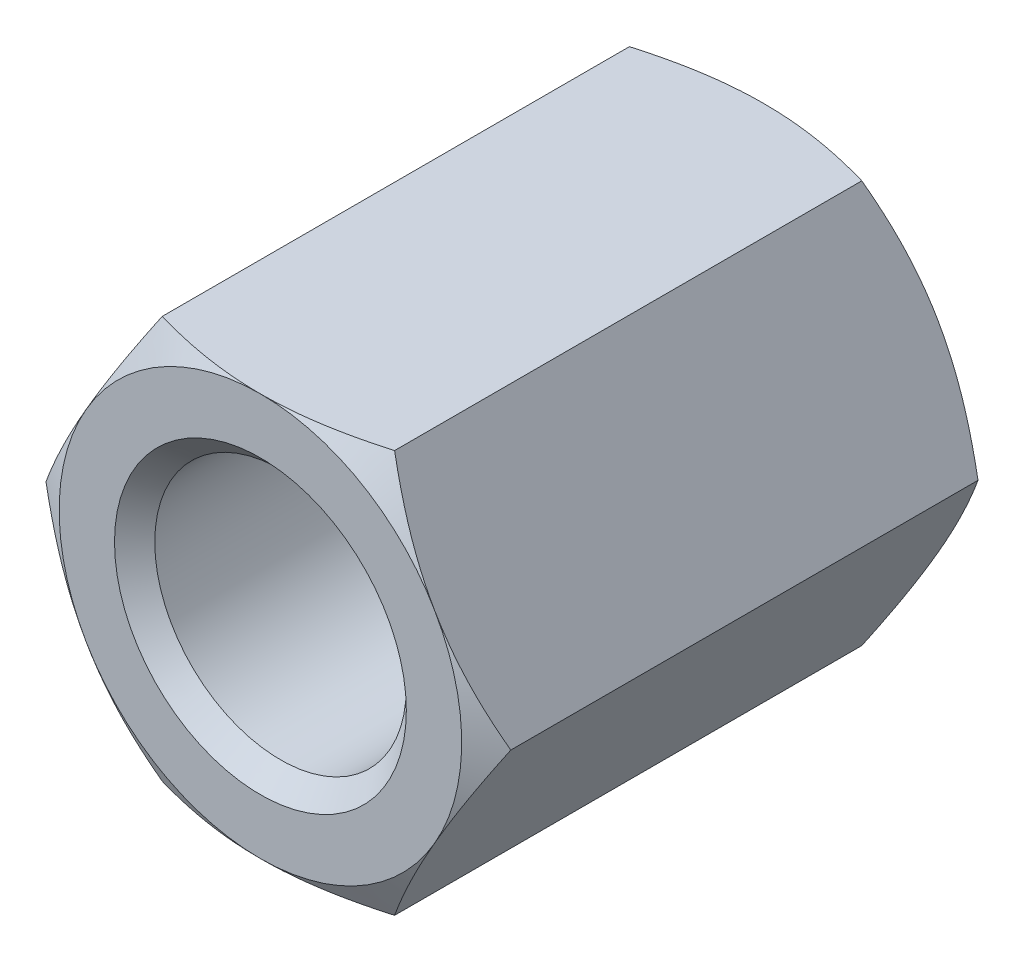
ISO-10303-21;
HEADER;
FILE_DESCRIPTION(('STEP AP214'),'2;1');
FILE_NAME('part.step','',(''),(''),'','','');
FILE_SCHEMA(('AUTOMOTIVE_DESIGN { 1 0 10303 214 1 1 1 1 }'));
ENDSEC;
DATA;
#1=APPLICATION_CONTEXT('core data for automotive mechanical design processes');
#2=APPLICATION_PROTOCOL_DEFINITION('international standard','automotive_design',2000,#1);
#3=PRODUCT_CONTEXT('',#1,'mechanical');
#4=PRODUCT('Part','Part','',(#3));
#5=PRODUCT_RELATED_PRODUCT_CATEGORY('part','',(#4));
#6=PRODUCT_DEFINITION_FORMATION('','',#4);
#7=PRODUCT_DEFINITION_CONTEXT('part definition',#1,'design');
#8=PRODUCT_DEFINITION('design','',#6,#7);
#9=PRODUCT_DEFINITION_SHAPE('','',#8);
#10=(LENGTH_UNIT() NAMED_UNIT(*) SI_UNIT(.MILLI.,.METRE.));
#11=(NAMED_UNIT(*) PLANE_ANGLE_UNIT() SI_UNIT($,.RADIAN.));
#12=(NAMED_UNIT(*) SI_UNIT($,.STERADIAN.) SOLID_ANGLE_UNIT());
#13=UNCERTAINTY_MEASURE_WITH_UNIT(LENGTH_MEASURE(1.E-05),#10,'distance_accuracy_value','');
#14=(GEOMETRIC_REPRESENTATION_CONTEXT(3) GLOBAL_UNCERTAINTY_ASSIGNED_CONTEXT((#13)) GLOBAL_UNIT_ASSIGNED_CONTEXT((#10,
#11,#12)) REPRESENTATION_CONTEXT('',''));
#15=CARTESIAN_POINT('',(0.,0.,0.));
#16=DIRECTION('',(0.,0.,1.));
#17=DIRECTION('',(1.,0.,0.));
#18=AXIS2_PLACEMENT_3D('',#15,#16,#17);
#19=CARTESIAN_POINT('',(4.61880215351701,0.,-5.));
#20=DIRECTION('',(0.866025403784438,0.5,0.));
#21=DIRECTION('',(-0.5,0.866025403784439,0.));
#22=AXIS2_PLACEMENT_3D('',#19,#20,#21);
#23=PLANE('',#22);
#24=CARTESIAN_POINT('',(4.61891762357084,-0.000199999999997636,4.64266774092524));
#25=CARTESIAN_POINT('',(4.5174314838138,0.17557915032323,4.70128212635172));
#26=CARTESIAN_POINT('',(4.41506932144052,0.352875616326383,4.75458967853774));
#27=CARTESIAN_POINT('',(4.20857250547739,0.710538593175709,4.8476383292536));
#28=CARTESIAN_POINT('',(4.10443418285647,0.890911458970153,4.8873465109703));
#29=CARTESIAN_POINT('',(3.89744813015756,1.24942181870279,4.94915778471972));
#30=CARTESIAN_POINT('',(3.79463224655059,1.42750415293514,4.97167226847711));
#31=CARTESIAN_POINT('',(3.58851671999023,1.78450671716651,4.99854937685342));
#32=CARTESIAN_POINT('',(3.48521782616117,1.9634256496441,5.00293425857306));
#33=CARTESIAN_POINT('',(3.29219970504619,2.29774284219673,4.99380992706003));
#34=CARTESIAN_POINT('',(3.20245157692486,2.45319115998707,4.98254104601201));
#35=CARTESIAN_POINT('',(3.02354002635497,2.76307505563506,4.94682600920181));
#36=CARTESIAN_POINT('',(2.93437722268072,2.91750956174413,4.92236765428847));
#37=CARTESIAN_POINT('',(2.75509682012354,3.22803232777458,4.86122393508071));
#38=CARTESIAN_POINT('',(2.6650019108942,3.3840812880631,4.82427939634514));
#39=CARTESIAN_POINT('',(2.48615580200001,3.69385183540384,4.74042992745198));
#40=CARTESIAN_POINT('',(2.39740231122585,3.84757739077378,4.69354469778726));
#41=CARTESIAN_POINT('',(2.30928560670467,4.0002,4.64266774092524));
#42=B_SPLINE_CURVE_WITH_KNOTS('',3,(#24,#25,#26,#27,#28,#29,#30,#31,#32,#33,#34,#35,#36,#37,#38,
#39,#40,#41),.UNSPECIFIED.,.F.,.F.,(4,2,2,2,2,2,2,2,4),(0.,0.634047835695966,1.26961969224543,
1.88946157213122,2.50854226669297,3.04757825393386,3.58711366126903,4.13861653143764,
4.68903648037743),.UNSPECIFIED.);
#43=CARTESIAN_POINT('',(4.61880215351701,0.,4.64273441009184));
#44=VERTEX_POINT('',#43);
#45=CARTESIAN_POINT('',(3.46410161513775,2.,5.));
#46=VERTEX_POINT('',#45);
#47=EDGE_CURVE('E127',#44,#46,#42,.T.);
#48=ORIENTED_EDGE('',*,*,#47,.F.);
#49=DIRECTION('',(0.,0.,1.));
#50=VECTOR('',#49,1.);
#51=CARTESIAN_POINT('',(4.61880215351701,0.,-5.));
#52=LINE('',#51,#50);
#53=CARTESIAN_POINT('',(4.61880215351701,0.,-4.64273441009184));
#54=VERTEX_POINT('',#53);
#55=EDGE_CURVE('E550',#54,#44,#52,.T.);
#56=ORIENTED_EDGE('',*,*,#55,.F.);
#57=CARTESIAN_POINT('',(4.61891762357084,-0.000199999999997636,-4.64266774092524));
#58=CARTESIAN_POINT('',(4.5174314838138,0.17557915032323,-4.70128212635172));
#59=CARTESIAN_POINT('',(4.41506932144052,0.352875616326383,-4.75458967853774));
#60=CARTESIAN_POINT('',(4.20857250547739,0.710538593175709,-4.8476383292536));
#61=CARTESIAN_POINT('',(4.10443418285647,0.890911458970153,-4.8873465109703));
#62=CARTESIAN_POINT('',(3.89744813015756,1.24942181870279,-4.94915778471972));
#63=CARTESIAN_POINT('',(3.79463224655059,1.42750415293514,-4.97167226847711));
#64=CARTESIAN_POINT('',(3.58851671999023,1.78450671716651,-4.99854937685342));
#65=CARTESIAN_POINT('',(3.48521782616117,1.9634256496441,-5.00293425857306));
#66=CARTESIAN_POINT('',(3.29219970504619,2.29774284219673,-4.99380992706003));
#67=CARTESIAN_POINT('',(3.20245157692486,2.45319115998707,-4.98254104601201));
#68=CARTESIAN_POINT('',(3.02354002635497,2.76307505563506,-4.94682600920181));
#69=CARTESIAN_POINT('',(2.93437722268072,2.91750956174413,-4.92236765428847));
#70=CARTESIAN_POINT('',(2.75509682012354,3.22803232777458,-4.86122393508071));
#71=CARTESIAN_POINT('',(2.6650019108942,3.3840812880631,-4.82427939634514));
#72=CARTESIAN_POINT('',(2.48615580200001,3.69385183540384,-4.74042992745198));
#73=CARTESIAN_POINT('',(2.39740231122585,3.84757739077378,-4.69354469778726));
#74=CARTESIAN_POINT('',(2.30928560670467,4.0002,-4.64266774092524));
#75=B_SPLINE_CURVE_WITH_KNOTS('',3,(#57,#58,#59,#60,#61,#62,#63,#64,#65,#66,#67,#68,#69,#70,#71,
#72,#73,#74),.UNSPECIFIED.,.F.,.F.,(4,2,2,2,2,2,2,2,4),(0.,0.634047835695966,1.26961969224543,
1.88946157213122,2.50854226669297,3.04757825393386,3.58711366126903,4.13861653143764,
4.68903648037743),.UNSPECIFIED.);
#76=CARTESIAN_POINT('',(3.46410161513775,2.,-5.));
#77=VERTEX_POINT('',#76);
#78=EDGE_CURVE('E568',#54,#77,#75,.T.);
#79=ORIENTED_EDGE('',*,*,#78,.T.);
#80=CARTESIAN_POINT('',(2.3094010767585,4.,-4.64273441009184));
#81=VERTEX_POINT('',#80);
#82=EDGE_CURVE('E268',#77,#81,#75,.T.);
#83=ORIENTED_EDGE('',*,*,#82,.T.);
#84=DIRECTION('',(0.,0.,1.));
#85=VECTOR('',#84,1.);
#86=CARTESIAN_POINT('',(2.3094010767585,4.,-5.));
#87=LINE('',#86,#85);
#88=CARTESIAN_POINT('',(2.3094010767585,4.,4.64273441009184));
#89=VERTEX_POINT('',#88);
#90=EDGE_CURVE('E159',#81,#89,#87,.T.);
#91=ORIENTED_EDGE('',*,*,#90,.T.);
#92=EDGE_CURVE('E140',#46,#89,#42,.T.);
#93=ORIENTED_EDGE('',*,*,#92,.F.);
#94=EDGE_LOOP('',(#48,#56,#79,#83,#91,#93));
#95=FACE_BOUND('',#94,.T.);
#96=ADVANCED_FACE('F41',(#95),#23,.T.);
#97=CARTESIAN_POINT('',(2.3094010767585,-4.,-5.));
#98=DIRECTION('',(0.866025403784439,-0.5,0.));
#99=DIRECTION('',(0.5,0.866025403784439,0.));
#100=AXIS2_PLACEMENT_3D('',#97,#98,#99);
#101=PLANE('',#100);
#102=CARTESIAN_POINT('',(2.30928560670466,-4.0002,4.64266774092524));
#103=CARTESIAN_POINT('',(2.4107717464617,-3.82442084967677,4.70128212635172));
#104=CARTESIAN_POINT('',(2.51313390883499,-3.64712438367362,4.75458967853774));
#105=CARTESIAN_POINT('',(2.71963072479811,-3.28946140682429,4.8476383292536));
#106=CARTESIAN_POINT('',(2.82376904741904,-3.10908854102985,4.8873465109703));
#107=CARTESIAN_POINT('',(3.03075510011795,-2.75057818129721,4.94915778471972));
#108=CARTESIAN_POINT('',(3.13357098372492,-2.57249584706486,4.97167226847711));
#109=CARTESIAN_POINT('',(3.33968651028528,-2.21549328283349,4.99854937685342));
#110=CARTESIAN_POINT('',(3.44298540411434,-2.0365743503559,5.00293425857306));
#111=CARTESIAN_POINT('',(3.63600352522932,-1.70225715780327,4.99380992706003));
#112=CARTESIAN_POINT('',(3.72575165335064,-1.54680884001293,4.98254104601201));
#113=CARTESIAN_POINT('',(3.90466320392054,-1.23692494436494,4.94682600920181));
#114=CARTESIAN_POINT('',(3.99382600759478,-1.08249043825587,4.92236765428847));
#115=CARTESIAN_POINT('',(4.17310641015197,-0.771967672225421,4.86122393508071));
#116=CARTESIAN_POINT('',(4.26320131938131,-0.615918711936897,4.82427939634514));
#117=CARTESIAN_POINT('',(4.4420474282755,-0.306148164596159,4.74042992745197));
#118=CARTESIAN_POINT('',(4.53080091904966,-0.152422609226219,4.69354469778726));
#119=CARTESIAN_POINT('',(4.61891762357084,0.000200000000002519,4.64266774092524));
#120=B_SPLINE_CURVE_WITH_KNOTS('',3,(#102,#103,#104,#105,#106,#107,#108,#109,#110,#111,#112,
#113,#114,#115,#116,#117,#118,#119),.UNSPECIFIED.,.F.,.F.,(4,2,2,2,2,2,2,2,4),(0.,
0.634047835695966,1.26961969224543,1.88946157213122,2.50854226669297,3.04757825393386,
3.58711366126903,4.13861653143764,4.68903648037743),.UNSPECIFIED.);
#121=CARTESIAN_POINT('',(2.3094010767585,-4.,4.64273441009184));
#122=VERTEX_POINT('',#121);
#123=CARTESIAN_POINT('',(3.46410161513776,-2.,5.));
#124=VERTEX_POINT('',#123);
#125=EDGE_CURVE('E534',#122,#124,#120,.T.);
#126=ORIENTED_EDGE('',*,*,#125,.F.);
#127=DIRECTION('',(0.,0.,1.));
#128=VECTOR('',#127,1.);
#129=CARTESIAN_POINT('',(2.3094010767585,-4.,-5.));
#130=LINE('',#129,#128);
#131=CARTESIAN_POINT('',(2.3094010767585,-4.,-4.64273441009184));
#132=VERTEX_POINT('',#131);
#133=EDGE_CURVE('E282',#132,#122,#130,.T.);
#134=ORIENTED_EDGE('',*,*,#133,.F.);
#135=CARTESIAN_POINT('',(2.30928560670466,-4.0002,-4.64266774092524));
#136=CARTESIAN_POINT('',(2.4107717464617,-3.82442084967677,-4.70128212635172));
#137=CARTESIAN_POINT('',(2.51313390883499,-3.64712438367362,-4.75458967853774));
#138=CARTESIAN_POINT('',(2.71963072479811,-3.28946140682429,-4.8476383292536));
#139=CARTESIAN_POINT('',(2.82376904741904,-3.10908854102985,-4.8873465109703));
#140=CARTESIAN_POINT('',(3.03075510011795,-2.75057818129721,-4.94915778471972));
#141=CARTESIAN_POINT('',(3.13357098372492,-2.57249584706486,-4.97167226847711));
#142=CARTESIAN_POINT('',(3.33968651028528,-2.21549328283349,-4.99854937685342));
#143=CARTESIAN_POINT('',(3.44298540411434,-2.0365743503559,-5.00293425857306));
#144=CARTESIAN_POINT('',(3.63600352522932,-1.70225715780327,-4.99380992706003));
#145=CARTESIAN_POINT('',(3.72575165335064,-1.54680884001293,-4.98254104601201));
#146=CARTESIAN_POINT('',(3.90466320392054,-1.23692494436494,-4.94682600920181));
#147=CARTESIAN_POINT('',(3.99382600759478,-1.08249043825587,-4.92236765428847));
#148=CARTESIAN_POINT('',(4.17310641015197,-0.771967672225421,-4.86122393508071));
#149=CARTESIAN_POINT('',(4.26320131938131,-0.615918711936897,-4.82427939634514));
#150=CARTESIAN_POINT('',(4.4420474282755,-0.306148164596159,-4.74042992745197));
#151=CARTESIAN_POINT('',(4.53080091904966,-0.152422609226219,-4.69354469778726));
#152=CARTESIAN_POINT('',(4.61891762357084,0.000200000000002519,-4.64266774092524));
#153=B_SPLINE_CURVE_WITH_KNOTS('',3,(#135,#136,#137,#138,#139,#140,#141,#142,#143,#144,#145,
#146,#147,#148,#149,#150,#151,#152),.UNSPECIFIED.,.F.,.F.,(4,2,2,2,2,2,2,2,4),(0.,
0.634047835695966,1.26961969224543,1.88946157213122,2.50854226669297,3.04757825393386,
3.58711366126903,4.13861653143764,4.68903648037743),.UNSPECIFIED.);
#154=CARTESIAN_POINT('',(3.46410161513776,-2.,-5.));
#155=VERTEX_POINT('',#154);
#156=EDGE_CURVE('E525',#132,#155,#153,.T.);
#157=ORIENTED_EDGE('',*,*,#156,.T.);
#158=EDGE_CURVE('E283',#155,#54,#153,.T.);
#159=ORIENTED_EDGE('',*,*,#158,.T.);
#160=ORIENTED_EDGE('',*,*,#55,.T.);
#161=EDGE_CURVE('E132',#124,#44,#120,.T.);
#162=ORIENTED_EDGE('',*,*,#161,.F.);
#163=EDGE_LOOP('',(#126,#134,#157,#159,#160,#162));
#164=FACE_BOUND('',#163,.T.);
#165=ADVANCED_FACE('F253',(#164),#101,.T.);
#166=CARTESIAN_POINT('',(-2.3094010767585,-4.,-5.));
#167=DIRECTION('',(0.,-1.,0.));
#168=DIRECTION('',(0.,0.,-1.));
#169=AXIS2_PLACEMENT_3D('',#166,#167,#168);
#170=PLANE('',#169);
#171=CARTESIAN_POINT('',(-11.5279836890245,-4.,0.264440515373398));
#172=CARTESIAN_POINT('',(-11.2715120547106,-4.,0.404321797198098));
#173=CARTESIAN_POINT('',(-11.014837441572,-4.,0.543832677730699));
#174=CARTESIAN_POINT('',(-10.5009754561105,-4.,0.821916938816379));
#175=CARTESIAN_POINT('',(-10.2437880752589,-4.,0.960490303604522));
#176=CARTESIAN_POINT('',(-9.72862819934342,-4.,1.2365914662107));
#177=CARTESIAN_POINT('',(-9.47065529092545,-4.,1.37411849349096));
#178=CARTESIAN_POINT('',(-8.95395916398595,-4.,1.64775277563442));
#179=CARTESIAN_POINT('',(-8.69523595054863,-4.,1.78386004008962));
#180=CARTESIAN_POINT('',(-8.16951167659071,-4.,2.05811973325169));
#181=CARTESIAN_POINT('',(-7.90248379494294,-4.,2.19622082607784));
#182=CARTESIAN_POINT('',(-7.36718088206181,-4.,2.46998268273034));
#183=CARTESIAN_POINT('',(-7.09890586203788,-4.,2.60564346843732));
#184=CARTESIAN_POINT('',(-6.5608262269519,-4.,2.87371521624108));
#185=CARTESIAN_POINT('',(-6.29102206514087,-4.,3.00612708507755));
#186=CARTESIAN_POINT('',(-5.74933668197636,-4.,3.26661334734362));
#187=CARTESIAN_POINT('',(-5.47745554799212,-4.,3.39468792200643));
#188=CARTESIAN_POINT('',(-4.92135065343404,-4.,3.64926272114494));
#189=CARTESIAN_POINT('',(-4.6370284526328,-4.,3.77555017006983));
#190=CARTESIAN_POINT('',(-4.20754891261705,-4.,3.95807487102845));
#191=CARTESIAN_POINT('',(-4.06386416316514,-4.,4.01777524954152));
#192=CARTESIAN_POINT('',(-3.77535865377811,-4.,4.13435814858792));
#193=CARTESIAN_POINT('',(-3.63053794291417,-4.,4.19124079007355));
#194=CARTESIAN_POINT('',(-3.34059820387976,-4.,4.30120468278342));
#195=CARTESIAN_POINT('',(-3.19548814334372,-4.,4.35430947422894));
#196=CARTESIAN_POINT('',(-2.90381608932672,-4.,4.45640888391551));
#197=CARTESIAN_POINT('',(-2.75725404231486,-4.,4.50540334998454));
#198=CARTESIAN_POINT('',(-2.46259054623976,-4.,4.59836548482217));
#199=CARTESIAN_POINT('',(-2.31448970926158,-4.,4.64233507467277));
#200=CARTESIAN_POINT('',(-2.01662643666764,-4.,4.72421146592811));
#201=CARTESIAN_POINT('',(-1.86686405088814,-4.,4.76211844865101));
#202=CARTESIAN_POINT('',(-1.49841751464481,-4.,4.84598275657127));
#203=CARTESIAN_POINT('',(-1.2787913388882,-4.,4.88798746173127));
#204=CARTESIAN_POINT('',(-0.947334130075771,-4.,4.93691975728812));
#205=CARTESIAN_POINT('',(-0.836518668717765,-4.,4.95088431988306));
#206=CARTESIAN_POINT('',(-0.61437144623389,-4.,4.97376962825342));
#207=CARTESIAN_POINT('',(-0.503039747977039,-4.,4.98269097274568));
#208=CARTESIAN_POINT('',(-0.280424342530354,-4.,4.99521270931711));
#209=CARTESIAN_POINT('',(-0.169141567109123,-4.,4.99882959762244));
#210=CARTESIAN_POINT('',(0.0534682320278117,-4.,5.00068760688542));
#211=CARTESIAN_POINT('',(0.164795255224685,-4.,4.99892878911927));
#212=CARTESIAN_POINT('',(0.387249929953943,-4.,4.99008741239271));
#213=CARTESIAN_POINT('',(0.498377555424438,-4.,4.98300420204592));
#214=CARTESIAN_POINT('',(0.72019050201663,-4.,4.96372103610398));
#215=CARTESIAN_POINT('',(0.830875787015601,-4.,4.95152067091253));
#216=CARTESIAN_POINT('',(1.09884160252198,-4.,4.91608140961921));
#217=CARTESIAN_POINT('',(1.25579519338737,-4.,4.89035300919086));
#218=CARTESIAN_POINT('',(1.56805927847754,-4.,4.83034903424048));
#219=CARTESIAN_POINT('',(1.72336945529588,-4.,4.79607183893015));
#220=CARTESIAN_POINT('',(2.03236005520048,-4.,4.72026345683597));
#221=CARTESIAN_POINT('',(2.186038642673,-4.,4.67872486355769));
#222=CARTESIAN_POINT('',(2.49163073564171,-4.,4.58966949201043));
#223=CARTESIAN_POINT('',(2.64354431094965,-4.,4.54215295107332));
#224=CARTESIAN_POINT('',(2.9484257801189,-4.,4.44134014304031));
#225=CARTESIAN_POINT('',(3.10136449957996,-4.,4.38795623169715));
#226=CARTESIAN_POINT('',(3.40573396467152,-4.,4.27707035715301));
#227=CARTESIAN_POINT('',(3.55716470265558,-4.,4.21956837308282));
#228=CARTESIAN_POINT('',(3.85861478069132,-4.,4.10125036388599));
#229=CARTESIAN_POINT('',(4.00863491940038,-4.,4.04043636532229));
#230=CARTESIAN_POINT('',(4.30753677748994,-4.,3.91606609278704));
#231=CARTESIAN_POINT('',(4.45641845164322,-4.,3.85250971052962));
#232=CARTESIAN_POINT('',(4.91043290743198,-4.,3.65463397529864));
#233=CARTESIAN_POINT('',(5.21398386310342,-4.,3.51668753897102));
#234=CARTESIAN_POINT('',(5.81806588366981,-4.,3.23432963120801));
#235=CARTESIAN_POINT('',(6.11859667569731,-4.,3.08991758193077));
#236=CARTESIAN_POINT('',(6.71756026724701,-4.,2.79643693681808));
#237=CARTESIAN_POINT('',(7.01599191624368,-4.,2.64736599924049));
#238=CARTESIAN_POINT('',(7.61116391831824,-4.,2.34588529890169));
#239=CARTESIAN_POINT('',(7.90790424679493,-4.,2.19347548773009));
#240=CARTESIAN_POINT('',(8.48290085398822,-4.,1.89507766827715));
#241=CARTESIAN_POINT('',(8.76123029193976,-4.,1.74923038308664));
#242=CARTESIAN_POINT('',(9.3169822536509,-4.,1.45581152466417));
#243=CARTESIAN_POINT('',(9.59440476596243,-4.,1.3082399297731));
#244=CARTESIAN_POINT('',(10.1481927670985,-4.,1.01191517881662));
#245=CARTESIAN_POINT('',(10.4245591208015,-4.,0.863163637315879));
#246=CARTESIAN_POINT('',(10.9766890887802,-4.,0.564562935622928));
#247=CARTESIAN_POINT('',(11.2524527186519,-4.,0.414713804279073));
#248=CARTESIAN_POINT('',(11.5279836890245,-4.,0.264440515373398));
#249=B_SPLINE_CURVE_WITH_KNOTS('',3,(#171,#172,#173,#174,#175,#176,#177,#178,#179,#180,#181,
#182,#183,#184,#185,#186,#187,#188,#189,#190,#191,#192,#193,#194,#195,#196,#197,#198,#199,#200,
#201,#202,#203,#204,#205,#206,#207,#208,#209,#210,#211,#212,#213,#214,#215,#216,#217,#218,#219,
#220,#221,#222,#223,#224,#225,#226,#227,#228,#229,#230,#231,#232,#233,#234,#235,#236,#237,#238,
#239,#240,#241,#242,#243,#244,#245,#246,#247,#248),.UNSPECIFIED.,.F.,.F.,(4,2,2,2,2,2,2,2,2,2,2,
2,2,2,2,2,2,2,2,2,2,2,2,2,2,2,2,2,2,2,2,2,2,2,2,2,2,2,4),(0.,0.876414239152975,1.75284317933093,
2.62986487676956,3.50688064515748,4.40874802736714,5.31060731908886,6.21221198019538,
7.11377892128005,8.04696753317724,8.51372602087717,8.98046445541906,9.44397948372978,
9.90751166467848,10.3708660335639,10.8342065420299,11.5042466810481,11.8392272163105,
12.1741679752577,12.5080648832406,12.8419579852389,13.17589194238,13.5098526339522,
13.986706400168,14.4636506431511,14.9410842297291,15.4184988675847,15.904390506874,
16.3902846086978,16.8758846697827,17.361503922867,18.3616495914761,19.3618848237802,
20.3626311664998,21.3633920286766,22.3060660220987,23.2487518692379,24.1903162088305,
25.1318558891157),.UNSPECIFIED.);
#250=CARTESIAN_POINT('',(-2.3094010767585,-4.,4.64273441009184));
#251=VERTEX_POINT('',#250);
#252=CARTESIAN_POINT('',(0.,-4.,5.));
#253=VERTEX_POINT('',#252);
#254=EDGE_CURVE('E535',#251,#253,#249,.T.);
#255=ORIENTED_EDGE('',*,*,#254,.F.);
#256=DIRECTION('',(0.,0.,1.));
#257=VECTOR('',#256,1.);
#258=CARTESIAN_POINT('',(-2.3094010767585,-4.,-5.));
#259=LINE('',#258,#257);
#260=CARTESIAN_POINT('',(-2.3094010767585,-4.,-4.64273441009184));
#261=VERTEX_POINT('',#260);
#262=EDGE_CURVE('E543',#261,#251,#259,.T.);
#263=ORIENTED_EDGE('',*,*,#262,.F.);
#264=CARTESIAN_POINT('',(-8.69602503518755,-4.,-1.78307464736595));
#265=CARTESIAN_POINT('',(-8.49611251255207,-4.,-1.88792065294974));
#266=CARTESIAN_POINT('',(-8.29594853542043,-4.,-1.99229080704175));
#267=CARTESIAN_POINT('',(-7.89499317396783,-4.,-2.19983732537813));
#268=CARTESIAN_POINT('',(-7.6942017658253,-4.,-2.30301364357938));
#269=CARTESIAN_POINT('',(-7.29160376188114,-4.,-2.50806421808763));
#270=CARTESIAN_POINT('',(-7.08979614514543,-4.,-2.60993647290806));
#271=CARTESIAN_POINT('',(-6.68528979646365,-4.,-2.81189167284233));
#272=CARTESIAN_POINT('',(-6.4825910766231,-4.,-2.91197464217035));
#273=CARTESIAN_POINT('',(-6.06448557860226,-4.,-3.11557048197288));
#274=CARTESIAN_POINT('',(-5.84901482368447,-4.,-3.21895229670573));
#275=CARTESIAN_POINT('',(-5.41656991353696,-4.,-3.42251948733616));
#276=CARTESIAN_POINT('',(-5.19959579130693,-4.,-3.52270493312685));
#277=CARTESIAN_POINT('',(-4.76386694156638,-4.,-3.71886671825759));
#278=CARTESIAN_POINT('',(-4.54511310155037,-4.,-3.81484501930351));
#279=CARTESIAN_POINT('',(-4.10527612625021,-4.,-4.0012803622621));
#280=CARTESIAN_POINT('',(-3.88419319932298,-4.,-4.09173789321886));
#281=CARTESIAN_POINT('',(-3.4154259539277,-4.,-4.27448818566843));
#282=CARTESIAN_POINT('',(-3.16741421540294,-4.,-4.36595206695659));
#283=CARTESIAN_POINT('',(-2.66696594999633,-4.,-4.53620795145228));
#284=CARTESIAN_POINT('',(-2.414528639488,-4.,-4.61499768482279));
#285=CARTESIAN_POINT('',(-1.90996213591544,-4.,-4.7533698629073));
#286=CARTESIAN_POINT('',(-1.6579378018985,-4.,-4.81332092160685));
#287=CARTESIAN_POINT('',(-1.27669072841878,-4.,-4.88621054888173));
#288=CARTESIAN_POINT('',(-1.14908560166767,-4.,-4.90766636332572));
#289=CARTESIAN_POINT('',(-0.892978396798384,-4.,-4.94423514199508));
#290=CARTESIAN_POINT('',(-0.764476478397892,-4.,-4.95934920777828));
#291=CARTESIAN_POINT('',(-0.504299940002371,-4.,-4.98292333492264));
#292=CARTESIAN_POINT('',(-0.372612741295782,-4.,-4.99124624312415));
#293=CARTESIAN_POINT('',(-0.108976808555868,-4.,-5.0003923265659));
#294=CARTESIAN_POINT('',(0.0229719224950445,-4.,-5.00121558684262));
#295=CARTESIAN_POINT('',(0.286704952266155,-4.,-4.99532522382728));
#296=CARTESIAN_POINT('',(0.418489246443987,-4.,-4.98861139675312));
#297=CARTESIAN_POINT('',(0.68147434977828,-4.,-4.96793379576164));
#298=CARTESIAN_POINT('',(0.81267514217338,-4.,-4.95396981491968));
#299=CARTESIAN_POINT('',(1.21065133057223,-4.,-4.90120738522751));
#300=CARTESIAN_POINT('',(1.47605192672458,-4.,-4.85169892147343));
#301=CARTESIAN_POINT('',(1.87020328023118,-4.,-4.76100184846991));
#302=CARTESIAN_POINT('',(2.00098109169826,-4.,-4.72801369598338));
#303=CARTESIAN_POINT('',(2.2612728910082,-4.,-4.65734443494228));
#304=CARTESIAN_POINT('',(2.3907868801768,-4.,-4.61966333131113));
#305=CARTESIAN_POINT('',(2.79931594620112,-4.,-4.49396970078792));
#306=CARTESIAN_POINT('',(3.07606767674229,-4.,-4.39862345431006));
#307=CARTESIAN_POINT('',(3.62485463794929,-4.,-4.19516528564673));
#308=CARTESIAN_POINT('',(3.89688778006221,-4.,-4.0870478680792));
#309=CARTESIAN_POINT('',(4.4377025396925,-4.,-3.86178687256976));
#310=CARTESIAN_POINT('',(4.70647788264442,-4.,-3.74462834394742));
#311=CARTESIAN_POINT('',(5.24114190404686,-4.,-3.50407341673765));
#312=CARTESIAN_POINT('',(5.50703109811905,-4.,-3.38067815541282));
#313=CARTESIAN_POINT('',(6.01890761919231,-4.,-3.13777103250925));
#314=CARTESIAN_POINT('',(6.26503489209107,-4.,-3.01855282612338));
#315=CARTESIAN_POINT('',(6.75582775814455,-4.,-2.77711941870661));
#316=CARTESIAN_POINT('',(7.00049327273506,-4.,-2.65490405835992));
#317=CARTESIAN_POINT('',(7.48750627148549,-4.,-2.40875757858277));
#318=CARTESIAN_POINT('',(7.729859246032,-4.,-2.28483729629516));
#319=CARTESIAN_POINT('',(8.21360283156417,-4.,-2.03519497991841));
#320=CARTESIAN_POINT('',(8.45499354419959,-4.,-1.90947314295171));
#321=CARTESIAN_POINT('',(8.69602503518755,-4.,-1.78307464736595));
#322=B_SPLINE_CURVE_WITH_KNOTS('',3,(#264,#265,#266,#267,#268,#269,#270,#271,#272,#273,#274,
#275,#276,#277,#278,#279,#280,#281,#282,#283,#284,#285,#286,#287,#288,#289,#290,#291,#292,#293,
#294,#295,#296,#297,#298,#299,#300,#301,#302,#303,#304,#305,#306,#307,#308,#309,#310,#311,#312,
#313,#314,#315,#316,#317,#318,#319,#320,#321),.UNSPECIFIED.,.F.,.F.,(4,2,2,2,2,2,2,2,2,2,2,2,2,
2,2,2,2,2,2,2,2,2,2,2,2,2,2,2,4),(0.,0.677216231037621,1.35445849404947,2.03263882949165,
2.71080998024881,3.42775480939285,4.1446839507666,4.86127516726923,5.57780281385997,
6.37057240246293,7.1634838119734,7.93974372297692,8.3277996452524,8.71578813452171,
9.11143089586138,9.50706917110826,9.90271814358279,10.2983784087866,11.1068625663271,
11.5114332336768,11.9160034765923,12.7936254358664,13.6716264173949,14.5511117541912,
15.4304372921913,16.2508534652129,17.0713133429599,17.8878960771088,18.7043901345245),.UNSPECIFIED.);
#323=CARTESIAN_POINT('',(0.,-4.,-5.));
#324=VERTEX_POINT('',#323);
#325=EDGE_CURVE('E552',#261,#324,#322,.T.);
#326=ORIENTED_EDGE('',*,*,#325,.T.);
#327=EDGE_CURVE('E258',#324,#132,#322,.T.);
#328=ORIENTED_EDGE('',*,*,#327,.T.);
#329=ORIENTED_EDGE('',*,*,#133,.T.);
#330=EDGE_CURVE('E138',#253,#122,#249,.T.);
#331=ORIENTED_EDGE('',*,*,#330,.F.);
#332=EDGE_LOOP('',(#255,#263,#326,#328,#329,#331));
#333=FACE_BOUND('',#332,.T.);
#334=ADVANCED_FACE('F291',(#333),#170,.T.);
#335=CARTESIAN_POINT('',(-4.61880215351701,0.,-5.));
#336=DIRECTION('',(-0.866025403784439,-0.5,0.));
#337=DIRECTION('',(0.5,-0.866025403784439,0.));
#338=AXIS2_PLACEMENT_3D('',#335,#336,#337);
#339=PLANE('',#338);
#340=CARTESIAN_POINT('',(-4.61891762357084,0.00020000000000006,4.64266774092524));
#341=CARTESIAN_POINT('',(-4.5174314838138,-0.175579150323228,4.70128212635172));
#342=CARTESIAN_POINT('',(-4.41506932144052,-0.352875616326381,4.75458967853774));
#343=CARTESIAN_POINT('',(-4.20857250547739,-0.710538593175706,4.8476383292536));
#344=CARTESIAN_POINT('',(-4.10443418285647,-0.890911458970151,4.8873465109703));
#345=CARTESIAN_POINT('',(-3.89744813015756,-1.24942181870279,4.94915778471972));
#346=CARTESIAN_POINT('',(-3.79463224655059,-1.42750415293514,4.97167226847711));
#347=CARTESIAN_POINT('',(-3.58851671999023,-1.78450671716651,4.99854937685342));
#348=CARTESIAN_POINT('',(-3.48521782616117,-1.9634256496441,5.00293425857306));
#349=CARTESIAN_POINT('',(-3.29219970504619,-2.29774284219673,4.99380992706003));
#350=CARTESIAN_POINT('',(-3.20245157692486,-2.45319115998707,4.98254104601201));
#351=CARTESIAN_POINT('',(-3.02354002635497,-2.76307505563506,4.94682600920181));
#352=CARTESIAN_POINT('',(-2.93437722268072,-2.91750956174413,4.92236765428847));
#353=CARTESIAN_POINT('',(-2.75509682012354,-3.22803232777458,4.86122393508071));
#354=CARTESIAN_POINT('',(-2.6650019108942,-3.3840812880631,4.82427939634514));
#355=CARTESIAN_POINT('',(-2.48615580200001,-3.69385183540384,4.74042992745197));
#356=CARTESIAN_POINT('',(-2.39740231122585,-3.84757739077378,4.69354469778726));
#357=CARTESIAN_POINT('',(-2.30928560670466,-4.0002,4.64266774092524));
#358=B_SPLINE_CURVE_WITH_KNOTS('',3,(#340,#341,#342,#343,#344,#345,#346,#347,#348,#349,#350,
#351,#352,#353,#354,#355,#356,#357),.UNSPECIFIED.,.F.,.F.,(4,2,2,2,2,2,2,2,4),(0.,
0.634047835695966,1.26961969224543,1.88946157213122,2.50854226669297,3.04757825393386,
3.58711366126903,4.13861653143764,4.68903648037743),.UNSPECIFIED.);
#359=CARTESIAN_POINT('',(-4.61880215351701,0.,4.64273441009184));
#360=VERTEX_POINT('',#359);
#361=CARTESIAN_POINT('',(-3.46410161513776,-2.,5.));
#362=VERTEX_POINT('',#361);
#363=EDGE_CURVE('E175',#360,#362,#358,.T.);
#364=ORIENTED_EDGE('',*,*,#363,.F.);
#365=DIRECTION('',(0.,0.,1.));
#366=VECTOR('',#365,1.);
#367=CARTESIAN_POINT('',(-4.61880215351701,0.,-5.));
#368=LINE('',#367,#366);
#369=CARTESIAN_POINT('',(-4.61880215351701,0.,-4.64273441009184));
#370=VERTEX_POINT('',#369);
#371=EDGE_CURVE('E539',#370,#360,#368,.T.);
#372=ORIENTED_EDGE('',*,*,#371,.F.);
#373=CARTESIAN_POINT('',(-4.61891762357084,0.000199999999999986,-4.64266774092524));
#374=CARTESIAN_POINT('',(-4.5174314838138,-0.175579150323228,-4.70128212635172));
#375=CARTESIAN_POINT('',(-4.41506932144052,-0.352875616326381,-4.75458967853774));
#376=CARTESIAN_POINT('',(-4.20857250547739,-0.710538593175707,-4.8476383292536));
#377=CARTESIAN_POINT('',(-4.10443418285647,-0.890911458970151,-4.8873465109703));
#378=CARTESIAN_POINT('',(-3.89744813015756,-1.24942181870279,-4.94915778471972));
#379=CARTESIAN_POINT('',(-3.79463224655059,-1.42750415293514,-4.97167226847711));
#380=CARTESIAN_POINT('',(-3.58851671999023,-1.78450671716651,-4.99854937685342));
#381=CARTESIAN_POINT('',(-3.48521782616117,-1.9634256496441,-5.00293425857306));
#382=CARTESIAN_POINT('',(-3.29219970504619,-2.29774284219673,-4.99380992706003));
#383=CARTESIAN_POINT('',(-3.20245157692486,-2.45319115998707,-4.98254104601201));
#384=CARTESIAN_POINT('',(-3.02354002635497,-2.76307505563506,-4.94682600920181));
#385=CARTESIAN_POINT('',(-2.93437722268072,-2.91750956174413,-4.92236765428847));
#386=CARTESIAN_POINT('',(-2.75509682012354,-3.22803232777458,-4.86122393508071));
#387=CARTESIAN_POINT('',(-2.6650019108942,-3.3840812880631,-4.82427939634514));
#388=CARTESIAN_POINT('',(-2.48615580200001,-3.69385183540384,-4.74042992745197));
#389=CARTESIAN_POINT('',(-2.39740231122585,-3.84757739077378,-4.69354469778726));
#390=CARTESIAN_POINT('',(-2.30928560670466,-4.0002,-4.64266774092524));
#391=B_SPLINE_CURVE_WITH_KNOTS('',3,(#373,#374,#375,#376,#377,#378,#379,#380,#381,#382,#383,
#384,#385,#386,#387,#388,#389,#390),.UNSPECIFIED.,.F.,.F.,(4,2,2,2,2,2,2,2,4),(0.,
0.634047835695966,1.26961969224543,1.88946157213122,2.50854226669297,3.04757825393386,
3.58711366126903,4.13861653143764,4.68903648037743),.UNSPECIFIED.);
#392=CARTESIAN_POINT('',(-3.46410161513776,-2.,-5.));
#393=VERTEX_POINT('',#392);
#394=EDGE_CURVE('E274',#370,#393,#391,.T.);
#395=ORIENTED_EDGE('',*,*,#394,.T.);
#396=EDGE_CURVE('E281',#393,#261,#391,.T.);
#397=ORIENTED_EDGE('',*,*,#396,.T.);
#398=ORIENTED_EDGE('',*,*,#262,.T.);
#399=EDGE_CURVE('E532',#362,#251,#358,.T.);
#400=ORIENTED_EDGE('',*,*,#399,.F.);
#401=EDGE_LOOP('',(#364,#372,#395,#397,#398,#400));
#402=FACE_BOUND('',#401,.T.);
#403=ADVANCED_FACE('F288',(#402),#339,.T.);
#404=CARTESIAN_POINT('',(-2.3094010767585,4.,-5.));
#405=DIRECTION('',(-0.866025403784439,0.5,0.));
#406=DIRECTION('',(-0.5,-0.866025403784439,0.));
#407=AXIS2_PLACEMENT_3D('',#404,#405,#406);
#408=PLANE('',#407);
#409=CARTESIAN_POINT('',(-2.30928560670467,4.0002,4.64266774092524));
#410=CARTESIAN_POINT('',(-2.41077174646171,3.82442084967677,4.70128212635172));
#411=CARTESIAN_POINT('',(-2.513133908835,3.64712438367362,4.75458967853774));
#412=CARTESIAN_POINT('',(-2.71963072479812,3.28946140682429,4.8476383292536));
#413=CARTESIAN_POINT('',(-2.82376904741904,3.10908854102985,4.8873465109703));
#414=CARTESIAN_POINT('',(-3.03075510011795,2.75057818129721,4.94915778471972));
#415=CARTESIAN_POINT('',(-3.13357098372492,2.57249584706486,4.97167226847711));
#416=CARTESIAN_POINT('',(-3.33968651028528,2.21549328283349,4.99854937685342));
#417=CARTESIAN_POINT('',(-3.44298540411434,2.0365743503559,5.00293425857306));
#418=CARTESIAN_POINT('',(-3.63600352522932,1.70225715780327,4.99380992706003));
#419=CARTESIAN_POINT('',(-3.72575165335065,1.54680884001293,4.98254104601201));
#420=CARTESIAN_POINT('',(-3.90466320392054,1.23692494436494,4.94682600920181));
#421=CARTESIAN_POINT('',(-3.99382600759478,1.08249043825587,4.92236765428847));
#422=CARTESIAN_POINT('',(-4.17310641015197,0.771967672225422,4.86122393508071));
#423=CARTESIAN_POINT('',(-4.26320131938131,0.615918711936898,4.82427939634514));
#424=CARTESIAN_POINT('',(-4.4420474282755,0.306148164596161,4.74042992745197));
#425=CARTESIAN_POINT('',(-4.53080091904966,0.152422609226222,4.69354469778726));
#426=CARTESIAN_POINT('',(-4.61891762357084,-0.000199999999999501,4.64266774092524));
#427=B_SPLINE_CURVE_WITH_KNOTS('',3,(#409,#410,#411,#412,#413,#414,#415,#416,#417,#418,#419,
#420,#421,#422,#423,#424,#425,#426),.UNSPECIFIED.,.F.,.F.,(4,2,2,2,2,2,2,2,4),(0.,
0.634047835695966,1.26961969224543,1.88946157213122,2.50854226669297,3.04757825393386,
3.58711366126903,4.13861653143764,4.68903648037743),.UNSPECIFIED.);
#428=CARTESIAN_POINT('',(-2.3094010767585,4.,4.64273441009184));
#429=VERTEX_POINT('',#428);
#430=CARTESIAN_POINT('',(-3.46410161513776,2.,5.));
#431=VERTEX_POINT('',#430);
#432=EDGE_CURVE('E182',#429,#431,#427,.T.);
#433=ORIENTED_EDGE('',*,*,#432,.F.);
#434=DIRECTION('',(0.,0.,1.));
#435=VECTOR('',#434,1.);
#436=CARTESIAN_POINT('',(-2.3094010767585,4.,-5.));
#437=LINE('',#436,#435);
#438=CARTESIAN_POINT('',(-2.3094010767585,4.,-4.64273441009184));
#439=VERTEX_POINT('',#438);
#440=EDGE_CURVE('E232',#439,#429,#437,.T.);
#441=ORIENTED_EDGE('',*,*,#440,.F.);
#442=CARTESIAN_POINT('',(-2.30928560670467,4.0002,-4.64266774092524));
#443=CARTESIAN_POINT('',(-2.41077174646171,3.82442084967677,-4.70128212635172));
#444=CARTESIAN_POINT('',(-2.513133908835,3.64712438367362,-4.75458967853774));
#445=CARTESIAN_POINT('',(-2.71963072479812,3.28946140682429,-4.8476383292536));
#446=CARTESIAN_POINT('',(-2.82376904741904,3.10908854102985,-4.8873465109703));
#447=CARTESIAN_POINT('',(-3.03075510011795,2.75057818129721,-4.94915778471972));
#448=CARTESIAN_POINT('',(-3.13357098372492,2.57249584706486,-4.97167226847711));
#449=CARTESIAN_POINT('',(-3.33968651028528,2.21549328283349,-4.99854937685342));
#450=CARTESIAN_POINT('',(-3.44298540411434,2.0365743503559,-5.00293425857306));
#451=CARTESIAN_POINT('',(-3.63600352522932,1.70225715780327,-4.99380992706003));
#452=CARTESIAN_POINT('',(-3.72575165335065,1.54680884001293,-4.98254104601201));
#453=CARTESIAN_POINT('',(-3.90466320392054,1.23692494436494,-4.94682600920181));
#454=CARTESIAN_POINT('',(-3.99382600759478,1.08249043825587,-4.92236765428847));
#455=CARTESIAN_POINT('',(-4.17310641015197,0.771967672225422,-4.86122393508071));
#456=CARTESIAN_POINT('',(-4.26320131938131,0.615918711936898,-4.82427939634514));
#457=CARTESIAN_POINT('',(-4.4420474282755,0.306148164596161,-4.74042992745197));
#458=CARTESIAN_POINT('',(-4.53080091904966,0.152422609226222,-4.69354469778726));
#459=CARTESIAN_POINT('',(-4.61891762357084,-0.000199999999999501,-4.64266774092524));
#460=B_SPLINE_CURVE_WITH_KNOTS('',3,(#442,#443,#444,#445,#446,#447,#448,#449,#450,#451,#452,
#453,#454,#455,#456,#457,#458,#459),.UNSPECIFIED.,.F.,.F.,(4,2,2,2,2,2,2,2,4),(0.,
0.634047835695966,1.26961969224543,1.88946157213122,2.50854226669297,3.04757825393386,
3.58711366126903,4.13861653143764,4.68903648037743),.UNSPECIFIED.);
#461=CARTESIAN_POINT('',(-3.46410161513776,2.,-5.));
#462=VERTEX_POINT('',#461);
#463=EDGE_CURVE('E236',#439,#462,#460,.T.);
#464=ORIENTED_EDGE('',*,*,#463,.T.);
#465=EDGE_CURVE('E595',#462,#370,#460,.T.);
#466=ORIENTED_EDGE('',*,*,#465,.T.);
#467=ORIENTED_EDGE('',*,*,#371,.T.);
#468=EDGE_CURVE('E530',#431,#360,#427,.T.);
#469=ORIENTED_EDGE('',*,*,#468,.F.);
#470=EDGE_LOOP('',(#433,#441,#464,#466,#467,#469));
#471=FACE_BOUND('',#470,.T.);
#472=ADVANCED_FACE('F217',(#471),#408,.T.);
#473=CARTESIAN_POINT('',(2.3094010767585,4.,-5.));
#474=DIRECTION('',(0.,1.,0.));
#475=DIRECTION('',(0.,0.,1.));
#476=AXIS2_PLACEMENT_3D('',#473,#474,#475);
#477=PLANE('',#476);
#478=CARTESIAN_POINT('',(11.5279836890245,4.,0.264440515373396));
#479=CARTESIAN_POINT('',(11.2715120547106,4.,0.404321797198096));
#480=CARTESIAN_POINT('',(11.014837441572,4.,0.543832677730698));
#481=CARTESIAN_POINT('',(10.5009754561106,4.,0.821916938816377));
#482=CARTESIAN_POINT('',(10.2437880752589,4.,0.96049030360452));
#483=CARTESIAN_POINT('',(9.72862819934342,4.,1.2365914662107));
#484=CARTESIAN_POINT('',(9.47065529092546,4.,1.37411849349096));
#485=CARTESIAN_POINT('',(8.95395916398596,4.,1.64775277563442));
#486=CARTESIAN_POINT('',(8.69523595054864,4.,1.78386004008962));
#487=CARTESIAN_POINT('',(8.16951167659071,4.,2.05811973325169));
#488=CARTESIAN_POINT('',(7.90248379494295,4.,2.19622082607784));
#489=CARTESIAN_POINT('',(7.36718088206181,4.,2.46998268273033));
#490=CARTESIAN_POINT('',(7.09890586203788,4.,2.60564346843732));
#491=CARTESIAN_POINT('',(6.5608262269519,4.,2.87371521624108));
#492=CARTESIAN_POINT('',(6.29102206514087,4.,3.00612708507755));
#493=CARTESIAN_POINT('',(5.74933668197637,4.,3.26661334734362));
#494=CARTESIAN_POINT('',(5.47745554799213,4.,3.39468792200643));
#495=CARTESIAN_POINT('',(4.92135065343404,4.,3.64926272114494));
#496=CARTESIAN_POINT('',(4.6370284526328,4.,3.77555017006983));
#497=CARTESIAN_POINT('',(4.20754891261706,4.,3.95807487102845));
#498=CARTESIAN_POINT('',(4.06386416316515,4.,4.01777524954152));
#499=CARTESIAN_POINT('',(3.77535865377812,4.,4.13435814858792));
#500=CARTESIAN_POINT('',(3.63053794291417,4.,4.19124079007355));
#501=CARTESIAN_POINT('',(3.34059820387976,4.,4.30120468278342));
#502=CARTESIAN_POINT('',(3.19548814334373,4.,4.35430947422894));
#503=CARTESIAN_POINT('',(2.90381608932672,4.,4.45640888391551));
#504=CARTESIAN_POINT('',(2.75725404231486,4.,4.50540334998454));
#505=CARTESIAN_POINT('',(2.46259054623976,4.,4.59836548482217));
#506=CARTESIAN_POINT('',(2.31448970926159,4.,4.64233507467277));
#507=CARTESIAN_POINT('',(2.01662643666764,4.,4.72421146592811));
#508=CARTESIAN_POINT('',(1.86686405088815,4.,4.76211844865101));
#509=CARTESIAN_POINT('',(1.49841751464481,4.,4.84598275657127));
#510=CARTESIAN_POINT('',(1.2787913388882,4.,4.88798746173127));
#511=CARTESIAN_POINT('',(0.947334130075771,4.,4.93691975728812));
#512=CARTESIAN_POINT('',(0.836518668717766,4.,4.95088431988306));
#513=CARTESIAN_POINT('',(0.614371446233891,4.,4.97376962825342));
#514=CARTESIAN_POINT('',(0.50303974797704,4.,4.98269097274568));
#515=CARTESIAN_POINT('',(0.280424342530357,4.,4.99521270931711));
#516=CARTESIAN_POINT('',(0.169141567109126,4.,4.99882959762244));
#517=CARTESIAN_POINT('',(-0.0534682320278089,4.,5.00068760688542));
#518=CARTESIAN_POINT('',(-0.164795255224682,4.,4.99892878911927));
#519=CARTESIAN_POINT('',(-0.387249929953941,4.,4.99008741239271));
#520=CARTESIAN_POINT('',(-0.498377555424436,4.,4.98300420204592));
#521=CARTESIAN_POINT('',(-0.720190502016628,4.,4.96372103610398));
#522=CARTESIAN_POINT('',(-0.830875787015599,4.,4.95152067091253));
#523=CARTESIAN_POINT('',(-1.09884160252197,4.,4.91608140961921));
#524=CARTESIAN_POINT('',(-1.25579519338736,4.,4.89035300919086));
#525=CARTESIAN_POINT('',(-1.56805927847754,4.,4.83034903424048));
#526=CARTESIAN_POINT('',(-1.72336945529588,4.,4.79607183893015));
#527=CARTESIAN_POINT('',(-2.03236005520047,4.,4.72026345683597));
#528=CARTESIAN_POINT('',(-2.186038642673,4.,4.67872486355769));
#529=CARTESIAN_POINT('',(-2.49163073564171,4.,4.58966949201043));
#530=CARTESIAN_POINT('',(-2.64354431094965,4.,4.54215295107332));
#531=CARTESIAN_POINT('',(-2.9484257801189,4.,4.44134014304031));
#532=CARTESIAN_POINT('',(-3.10136449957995,4.,4.38795623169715));
#533=CARTESIAN_POINT('',(-3.40573396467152,4.,4.27707035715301));
#534=CARTESIAN_POINT('',(-3.55716470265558,4.,4.21956837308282));
#535=CARTESIAN_POINT('',(-3.85861478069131,4.,4.10125036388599));
#536=CARTESIAN_POINT('',(-4.00863491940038,4.,4.0404363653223));
#537=CARTESIAN_POINT('',(-4.30753677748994,4.,3.91606609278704));
#538=CARTESIAN_POINT('',(-4.45641845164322,4.,3.85250971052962));
#539=CARTESIAN_POINT('',(-4.91043290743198,4.,3.65463397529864));
#540=CARTESIAN_POINT('',(-5.21398386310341,4.,3.51668753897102));
#541=CARTESIAN_POINT('',(-5.8180658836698,4.,3.23432963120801));
#542=CARTESIAN_POINT('',(-6.1185966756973,4.,3.08991758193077));
#543=CARTESIAN_POINT('',(-6.71756026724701,4.,2.79643693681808));
#544=CARTESIAN_POINT('',(-7.01599191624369,4.,2.64736599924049));
#545=CARTESIAN_POINT('',(-7.61116391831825,4.,2.34588529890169));
#546=CARTESIAN_POINT('',(-7.90790424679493,4.,2.19347548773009));
#547=CARTESIAN_POINT('',(-8.48290085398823,4.,1.89507766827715));
#548=CARTESIAN_POINT('',(-8.76123029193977,4.,1.74923038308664));
#549=CARTESIAN_POINT('',(-9.3169822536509,4.,1.45581152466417));
#550=CARTESIAN_POINT('',(-9.59440476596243,4.,1.3082399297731));
#551=CARTESIAN_POINT('',(-10.1481927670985,4.,1.01191517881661));
#552=CARTESIAN_POINT('',(-10.4245591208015,4.,0.863163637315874));
#553=CARTESIAN_POINT('',(-10.9766890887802,4.,0.564562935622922));
#554=CARTESIAN_POINT('',(-11.2524527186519,4.,0.414713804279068));
#555=CARTESIAN_POINT('',(-11.5279836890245,4.,0.264440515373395));
#556=B_SPLINE_CURVE_WITH_KNOTS('',3,(#478,#479,#480,#481,#482,#483,#484,#485,#486,#487,#488,
#489,#490,#491,#492,#493,#494,#495,#496,#497,#498,#499,#500,#501,#502,#503,#504,#505,#506,#507,
#508,#509,#510,#511,#512,#513,#514,#515,#516,#517,#518,#519,#520,#521,#522,#523,#524,#525,#526,
#527,#528,#529,#530,#531,#532,#533,#534,#535,#536,#537,#538,#539,#540,#541,#542,#543,#544,#545,
#546,#547,#548,#549,#550,#551,#552,#553,#554,#555),.UNSPECIFIED.,.F.,.F.,(4,2,2,2,2,2,2,2,2,2,2,
2,2,2,2,2,2,2,2,2,2,2,2,2,2,2,2,2,2,2,2,2,2,2,2,2,2,2,4),(0.,0.876414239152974,1.75284317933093,
2.62986487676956,3.50688064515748,4.40874802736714,5.31060731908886,6.21221198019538,
7.11377892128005,8.04696753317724,8.51372602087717,8.98046445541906,9.44397948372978,
9.90751166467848,10.3708660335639,10.8342065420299,11.5042466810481,11.8392272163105,
12.1741679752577,12.5080648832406,12.8419579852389,13.17589194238,13.5098526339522,
13.986706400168,14.4636506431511,14.9410842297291,15.4184988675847,15.904390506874,
16.3902846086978,16.8758846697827,17.361503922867,18.3616495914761,19.3618848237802,
20.3626311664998,21.3633920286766,22.3060660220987,23.2487518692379,24.1903162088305,
25.1318558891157),.UNSPECIFIED.);
#557=CARTESIAN_POINT('',(0.,4.,5.));
#558=VERTEX_POINT('',#557);
#559=EDGE_CURVE('E145',#89,#558,#556,.T.);
#560=ORIENTED_EDGE('',*,*,#559,.F.);
#561=ORIENTED_EDGE('',*,*,#90,.F.);
#562=CARTESIAN_POINT('',(8.69602503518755,4.,-1.78307464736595));
#563=CARTESIAN_POINT('',(8.49611251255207,4.,-1.88792065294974));
#564=CARTESIAN_POINT('',(8.29594853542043,4.,-1.99229080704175));
#565=CARTESIAN_POINT('',(7.89499317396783,4.,-2.19983732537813));
#566=CARTESIAN_POINT('',(7.6942017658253,4.,-2.30301364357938));
#567=CARTESIAN_POINT('',(7.29160376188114,4.,-2.50806421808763));
#568=CARTESIAN_POINT('',(7.08979614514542,4.,-2.60993647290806));
#569=CARTESIAN_POINT('',(6.68528979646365,4.,-2.81189167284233));
#570=CARTESIAN_POINT('',(6.4825910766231,4.,-2.91197464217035));
#571=CARTESIAN_POINT('',(6.06448557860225,4.,-3.11557048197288));
#572=CARTESIAN_POINT('',(5.84901482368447,4.,-3.21895229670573));
#573=CARTESIAN_POINT('',(5.41656991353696,4.,-3.42251948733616));
#574=CARTESIAN_POINT('',(5.19959579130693,4.,-3.52270493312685));
#575=CARTESIAN_POINT('',(4.76386694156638,4.,-3.71886671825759));
#576=CARTESIAN_POINT('',(4.54511310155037,4.,-3.81484501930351));
#577=CARTESIAN_POINT('',(4.10527612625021,4.,-4.0012803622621));
#578=CARTESIAN_POINT('',(3.88419319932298,4.,-4.09173789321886));
#579=CARTESIAN_POINT('',(3.4154259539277,4.,-4.27448818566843));
#580=CARTESIAN_POINT('',(3.16741421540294,4.,-4.36595206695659));
#581=CARTESIAN_POINT('',(2.66696594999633,4.,-4.53620795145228));
#582=CARTESIAN_POINT('',(2.414528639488,4.,-4.61499768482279));
#583=CARTESIAN_POINT('',(1.90996213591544,4.,-4.7533698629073));
#584=CARTESIAN_POINT('',(1.6579378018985,4.,-4.81332092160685));
#585=CARTESIAN_POINT('',(1.27669072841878,4.,-4.88621054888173));
#586=CARTESIAN_POINT('',(1.14908560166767,4.,-4.90766636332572));
#587=CARTESIAN_POINT('',(0.892978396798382,4.,-4.94423514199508));
#588=CARTESIAN_POINT('',(0.764476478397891,4.,-4.95934920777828));
#589=CARTESIAN_POINT('',(0.504299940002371,4.,-4.98292333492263));
#590=CARTESIAN_POINT('',(0.372612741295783,4.,-4.99124624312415));
#591=CARTESIAN_POINT('',(0.108976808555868,4.,-5.0003923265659));
#592=CARTESIAN_POINT('',(-0.0229719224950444,4.,-5.00121558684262));
#593=CARTESIAN_POINT('',(-0.286704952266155,4.,-4.99532522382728));
#594=CARTESIAN_POINT('',(-0.418489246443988,4.,-4.98861139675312));
#595=CARTESIAN_POINT('',(-0.681474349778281,4.,-4.96793379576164));
#596=CARTESIAN_POINT('',(-0.81267514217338,4.,-4.95396981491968));
#597=CARTESIAN_POINT('',(-1.21065133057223,4.,-4.9012073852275));
#598=CARTESIAN_POINT('',(-1.47605192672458,4.,-4.85169892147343));
#599=CARTESIAN_POINT('',(-1.87020328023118,4.,-4.76100184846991));
#600=CARTESIAN_POINT('',(-2.00098109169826,4.,-4.72801369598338));
#601=CARTESIAN_POINT('',(-2.2612728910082,4.,-4.65734443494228));
#602=CARTESIAN_POINT('',(-2.3907868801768,4.,-4.61966333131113));
#603=CARTESIAN_POINT('',(-2.79931594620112,4.,-4.49396970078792));
#604=CARTESIAN_POINT('',(-3.07606767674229,4.,-4.39862345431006));
#605=CARTESIAN_POINT('',(-3.62485463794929,4.,-4.19516528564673));
#606=CARTESIAN_POINT('',(-3.89688778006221,4.,-4.0870478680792));
#607=CARTESIAN_POINT('',(-4.4377025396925,4.,-3.86178687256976));
#608=CARTESIAN_POINT('',(-4.70647788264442,4.,-3.74462834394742));
#609=CARTESIAN_POINT('',(-5.24114190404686,4.,-3.50407341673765));
#610=CARTESIAN_POINT('',(-5.50703109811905,4.,-3.38067815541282));
#611=CARTESIAN_POINT('',(-6.01890761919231,4.,-3.13777103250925));
#612=CARTESIAN_POINT('',(-6.26503489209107,4.,-3.01855282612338));
#613=CARTESIAN_POINT('',(-6.75582775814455,4.,-2.77711941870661));
#614=CARTESIAN_POINT('',(-7.00049327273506,4.,-2.65490405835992));
#615=CARTESIAN_POINT('',(-7.48750627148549,4.,-2.40875757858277));
#616=CARTESIAN_POINT('',(-7.729859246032,4.,-2.28483729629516));
#617=CARTESIAN_POINT('',(-8.21360283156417,4.,-2.03519497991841));
#618=CARTESIAN_POINT('',(-8.45499354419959,4.,-1.90947314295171));
#619=CARTESIAN_POINT('',(-8.69602503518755,4.,-1.78307464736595));
#620=B_SPLINE_CURVE_WITH_KNOTS('',3,(#562,#563,#564,#565,#566,#567,#568,#569,#570,#571,#572,
#573,#574,#575,#576,#577,#578,#579,#580,#581,#582,#583,#584,#585,#586,#587,#588,#589,#590,#591,
#592,#593,#594,#595,#596,#597,#598,#599,#600,#601,#602,#603,#604,#605,#606,#607,#608,#609,#610,
#611,#612,#613,#614,#615,#616,#617,#618,#619),.UNSPECIFIED.,.F.,.F.,(4,2,2,2,2,2,2,2,2,2,2,2,2,
2,2,2,2,2,2,2,2,2,2,2,2,2,2,2,4),(0.,0.677216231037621,1.35445849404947,2.03263882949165,
2.71080998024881,3.42775480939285,4.1446839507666,4.86127516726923,5.57780281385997,
6.37057240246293,7.1634838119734,7.93974372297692,8.32779964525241,8.71578813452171,
9.11143089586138,9.50706917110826,9.90271814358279,10.2983784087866,11.1068625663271,
11.5114332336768,11.9160034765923,12.7936254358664,13.6716264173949,14.5511117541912,
15.4304372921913,16.2508534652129,17.0713133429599,17.8878960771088,18.7043901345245),.UNSPECIFIED.);
#621=CARTESIAN_POINT('',(0.,4.,-5.));
#622=VERTEX_POINT('',#621);
#623=EDGE_CURVE('E233',#81,#622,#620,.T.);
#624=ORIENTED_EDGE('',*,*,#623,.T.);
#625=EDGE_CURVE('E222',#622,#439,#620,.T.);
#626=ORIENTED_EDGE('',*,*,#625,.T.);
#627=ORIENTED_EDGE('',*,*,#440,.T.);
#628=EDGE_CURVE('E161',#558,#429,#556,.T.);
#629=ORIENTED_EDGE('',*,*,#628,.F.);
#630=EDGE_LOOP('',(#560,#561,#624,#626,#627,#629));
#631=FACE_BOUND('',#630,.T.);
#632=ADVANCED_FACE('F213',(#631),#477,.T.);
#633=CARTESIAN_POINT('',(0.,0.,-5.));
#634=DIRECTION('',(0.,0.,1.));
#635=DIRECTION('',(-1.,0.,0.));
#636=AXIS2_PLACEMENT_3D('',#633,#634,#635);
#637=CONICAL_SURFACE('',#636,4.,1.0471975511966);
#638=CARTESIAN_POINT('',(0.,0.,-5.));
#639=DIRECTION('',(0.,0.,1.));
#640=DIRECTION('',(1.,0.,0.));
#641=AXIS2_PLACEMENT_3D('',#638,#639,#640);
#642=CIRCLE('',#641,4.);
#643=EDGE_CURVE('E544',#155,#77,#642,.T.);
#644=ORIENTED_EDGE('',*,*,#643,.T.);
#645=ORIENTED_EDGE('',*,*,#78,.F.);
#646=ORIENTED_EDGE('',*,*,#158,.F.);
#647=EDGE_LOOP('',(#644,#645,#646));
#648=FACE_BOUND('',#647,.T.);
#649=ADVANCED_FACE('F216',(#648),#637,.T.);
#650=EDGE_CURVE('E547',#324,#155,#642,.T.);
#651=ORIENTED_EDGE('',*,*,#650,.T.);
#652=ORIENTED_EDGE('',*,*,#156,.F.);
#653=ORIENTED_EDGE('',*,*,#327,.F.);
#654=EDGE_LOOP('',(#651,#652,#653));
#655=FACE_BOUND('',#654,.T.);
#656=ADVANCED_FACE('F336',(#655),#637,.T.);
#657=ORIENTED_EDGE('',*,*,#396,.F.);
#658=EDGE_CURVE('E558',#393,#324,#642,.T.);
#659=ORIENTED_EDGE('',*,*,#658,.T.);
#660=ORIENTED_EDGE('',*,*,#325,.F.);
#661=EDGE_LOOP('',(#657,#659,#660));
#662=FACE_BOUND('',#661,.T.);
#663=ADVANCED_FACE('F250',(#662),#637,.T.);
#664=ORIENTED_EDGE('',*,*,#465,.F.);
#665=EDGE_CURVE('E561',#462,#393,#642,.T.);
#666=ORIENTED_EDGE('',*,*,#665,.T.);
#667=ORIENTED_EDGE('',*,*,#394,.F.);
#668=EDGE_LOOP('',(#664,#666,#667));
#669=FACE_BOUND('',#668,.T.);
#670=ADVANCED_FACE('F248',(#669),#637,.T.);
#671=ORIENTED_EDGE('',*,*,#625,.F.);
#672=CARTESIAN_POINT('',(0.,0.,-5.));
#673=DIRECTION('',(0.,0.,-1.));
#674=DIRECTION('',(-1.,0.,0.));
#675=AXIS2_PLACEMENT_3D('',#672,#673,#674);
#676=CIRCLE('',#675,4.);
#677=EDGE_CURVE('E234',#462,#622,#676,.T.);
#678=ORIENTED_EDGE('',*,*,#677,.F.);
#679=ORIENTED_EDGE('',*,*,#463,.F.);
#680=EDGE_LOOP('',(#671,#678,#679));
#681=FACE_BOUND('',#680,.T.);
#682=ADVANCED_FACE('F242',(#681),#637,.T.);
#683=EDGE_CURVE('E548',#77,#622,#642,.T.);
#684=ORIENTED_EDGE('',*,*,#683,.T.);
#685=ORIENTED_EDGE('',*,*,#623,.F.);
#686=ORIENTED_EDGE('',*,*,#82,.F.);
#687=EDGE_LOOP('',(#684,#685,#686));
#688=FACE_BOUND('',#687,.T.);
#689=ADVANCED_FACE('F247',(#688),#637,.T.);
#690=CARTESIAN_POINT('',(0.,0.,-5.));
#691=DIRECTION('',(0.,0.,1.));
#692=DIRECTION('',(1.,0.,0.));
#693=AXIS2_PLACEMENT_3D('',#690,#691,#692);
#694=PLANE('',#693);
#695=CARTESIAN_POINT('',(0.,0.,-5.));
#696=DIRECTION('',(0.,0.,1.));
#697=DIRECTION('',(1.,0.,0.));
#698=AXIS2_PLACEMENT_3D('',#695,#696,#697);
#699=CIRCLE('',#698,2.9);
#700=CARTESIAN_POINT('',(2.9,0.,-5.));
#701=VERTEX_POINT('',#700);
#702=EDGE_CURVE('E555',#701,#701,#699,.T.);
#703=ORIENTED_EDGE('',*,*,#702,.T.);
#704=EDGE_LOOP('',(#703));
#705=FACE_BOUND('',#704,.T.);
#706=ORIENTED_EDGE('',*,*,#683,.F.);
#707=ORIENTED_EDGE('',*,*,#643,.F.);
#708=ORIENTED_EDGE('',*,*,#650,.F.);
#709=ORIENTED_EDGE('',*,*,#658,.F.);
#710=ORIENTED_EDGE('',*,*,#665,.F.);
#711=ORIENTED_EDGE('',*,*,#677,.T.);
#712=EDGE_LOOP('',(#706,#707,#708,#709,#710,#711));
#713=FACE_BOUND('',#712,.T.);
#714=ADVANCED_FACE('F370',(#705,#713),#694,.F.);
#715=CARTESIAN_POINT('',(0.,0.,0.));
#716=DIRECTION('',(0.,0.,-1.));
#717=DIRECTION('',(-1.,0.,0.));
#718=AXIS2_PLACEMENT_3D('',#715,#716,#717);
#719=CYLINDRICAL_SURFACE('',#718,2.5);
#720=CARTESIAN_POINT('',(0.,0.,4.6));
#721=DIRECTION('',(0.,0.,-1.));
#722=DIRECTION('',(-1.,0.,0.));
#723=AXIS2_PLACEMENT_3D('',#720,#721,#722);
#724=CIRCLE('',#723,2.5);
#725=CARTESIAN_POINT('',(-2.5,0.,4.6));
#726=VERTEX_POINT('',#725);
#727=EDGE_CURVE('E12',#726,#726,#724,.F.);
#728=ORIENTED_EDGE('',*,*,#727,.T.);
#729=EDGE_LOOP('',(#728));
#730=FACE_BOUND('',#729,.T.);
#731=CARTESIAN_POINT('',(0.,0.,-4.6));
#732=DIRECTION('',(0.,0.,1.));
#733=DIRECTION('',(1.,0.,0.));
#734=AXIS2_PLACEMENT_3D('',#731,#732,#733);
#735=CIRCLE('',#734,2.5);
#736=CARTESIAN_POINT('',(2.5,0.,-4.6));
#737=VERTEX_POINT('',#736);
#738=EDGE_CURVE('E531',#737,#737,#735,.F.);
#739=ORIENTED_EDGE('',*,*,#738,.T.);
#740=EDGE_LOOP('',(#739));
#741=FACE_BOUND('',#740,.T.);
#742=ADVANCED_FACE('F251',(#730,#741),#719,.F.);
#743=CARTESIAN_POINT('',(0.,0.,-4.6));
#744=DIRECTION('',(0.,0.,-1.));
#745=DIRECTION('',(-1.,0.,0.));
#746=AXIS2_PLACEMENT_3D('',#743,#744,#745);
#747=CONICAL_SURFACE('',#746,2.5,0.785398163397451);
#748=ORIENTED_EDGE('',*,*,#702,.F.);
#749=EDGE_LOOP('',(#748));
#750=FACE_BOUND('',#749,.T.);
#751=ORIENTED_EDGE('',*,*,#738,.F.);
#752=EDGE_LOOP('',(#751));
#753=FACE_BOUND('',#752,.T.);
#754=ADVANCED_FACE('F385',(#750,#753),#747,.F.);
#755=CARTESIAN_POINT('',(0.,0.,5.));
#756=DIRECTION('',(0.,0.,-1.));
#757=DIRECTION('',(-1.,0.,0.));
#758=AXIS2_PLACEMENT_3D('',#755,#756,#757);
#759=CONICAL_SURFACE('',#758,4.,1.0471975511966);
#760=ORIENTED_EDGE('',*,*,#363,.T.);
#761=CARTESIAN_POINT('',(0.,0.,5.));
#762=DIRECTION('',(0.,0.,-1.));
#763=DIRECTION('',(-1.,0.,0.));
#764=AXIS2_PLACEMENT_3D('',#761,#762,#763);
#765=CIRCLE('',#764,4.);
#766=EDGE_CURVE('E149',#431,#362,#765,.F.);
#767=ORIENTED_EDGE('',*,*,#766,.F.);
#768=ORIENTED_EDGE('',*,*,#468,.T.);
#769=EDGE_LOOP('',(#760,#767,#768));
#770=FACE_BOUND('',#769,.T.);
#771=ADVANCED_FACE('F193',(#770),#759,.T.);
#772=ORIENTED_EDGE('',*,*,#432,.T.);
#773=CARTESIAN_POINT('',(0.,0.,5.));
#774=DIRECTION('',(0.,0.,-1.));
#775=DIRECTION('',(-1.,0.,0.));
#776=AXIS2_PLACEMENT_3D('',#773,#774,#775);
#777=CIRCLE('',#776,4.);
#778=EDGE_CURVE('E166',#431,#558,#777,.T.);
#779=ORIENTED_EDGE('',*,*,#778,.T.);
#780=ORIENTED_EDGE('',*,*,#628,.T.);
#781=EDGE_LOOP('',(#772,#779,#780));
#782=FACE_BOUND('',#781,.T.);
#783=ADVANCED_FACE('F190',(#782),#759,.T.);
#784=ORIENTED_EDGE('',*,*,#92,.T.);
#785=ORIENTED_EDGE('',*,*,#559,.T.);
#786=EDGE_CURVE('E59',#46,#558,#765,.F.);
#787=ORIENTED_EDGE('',*,*,#786,.F.);
#788=EDGE_LOOP('',(#784,#785,#787));
#789=FACE_BOUND('',#788,.T.);
#790=ADVANCED_FACE('F143',(#789),#759,.T.);
#791=ORIENTED_EDGE('',*,*,#161,.T.);
#792=ORIENTED_EDGE('',*,*,#47,.T.);
#793=EDGE_CURVE('E129',#124,#46,#765,.F.);
#794=ORIENTED_EDGE('',*,*,#793,.F.);
#795=EDGE_LOOP('',(#791,#792,#794));
#796=FACE_BOUND('',#795,.T.);
#797=ADVANCED_FACE('F128',(#796),#759,.T.);
#798=ORIENTED_EDGE('',*,*,#330,.T.);
#799=ORIENTED_EDGE('',*,*,#125,.T.);
#800=EDGE_CURVE('E154',#253,#124,#765,.F.);
#801=ORIENTED_EDGE('',*,*,#800,.F.);
#802=EDGE_LOOP('',(#798,#799,#801));
#803=FACE_BOUND('',#802,.T.);
#804=ADVANCED_FACE('F419',(#803),#759,.T.);
#805=ORIENTED_EDGE('',*,*,#254,.T.);
#806=EDGE_CURVE('E619',#362,#253,#765,.F.);
#807=ORIENTED_EDGE('',*,*,#806,.F.);
#808=ORIENTED_EDGE('',*,*,#399,.T.);
#809=EDGE_LOOP('',(#805,#807,#808));
#810=FACE_BOUND('',#809,.T.);
#811=ADVANCED_FACE('F195',(#810),#759,.T.);
#812=CARTESIAN_POINT('',(0.,0.,5.));
#813=DIRECTION('',(0.,0.,-1.));
#814=DIRECTION('',(1.,0.,0.));
#815=AXIS2_PLACEMENT_3D('',#812,#813,#814);
#816=PLANE('',#815);
#817=CARTESIAN_POINT('',(0.,0.,5.));
#818=DIRECTION('',(0.,0.,-1.));
#819=DIRECTION('',(-1.,0.,0.));
#820=AXIS2_PLACEMENT_3D('',#817,#818,#819);
#821=CIRCLE('',#820,2.90000000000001);
#822=CARTESIAN_POINT('',(-2.90000000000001,0.,5.));
#823=VERTEX_POINT('',#822);
#824=EDGE_CURVE('E51',#823,#823,#821,.T.);
#825=ORIENTED_EDGE('',*,*,#824,.T.);
#826=EDGE_LOOP('',(#825));
#827=FACE_BOUND('',#826,.T.);
#828=ORIENTED_EDGE('',*,*,#766,.T.);
#829=ORIENTED_EDGE('',*,*,#806,.T.);
#830=ORIENTED_EDGE('',*,*,#800,.T.);
#831=ORIENTED_EDGE('',*,*,#793,.T.);
#832=ORIENTED_EDGE('',*,*,#786,.T.);
#833=ORIENTED_EDGE('',*,*,#778,.F.);
#834=EDGE_LOOP('',(#828,#829,#830,#831,#832,#833));
#835=FACE_BOUND('',#834,.T.);
#836=ADVANCED_FACE('F151',(#827,#835),#816,.F.);
#837=CARTESIAN_POINT('',(0.,0.,5.));
#838=DIRECTION('',(0.,0.,1.));
#839=DIRECTION('',(1.,0.,0.));
#840=AXIS2_PLACEMENT_3D('',#837,#838,#839);
#841=CONICAL_SURFACE('',#840,2.90000000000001,0.785398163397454);
#842=ORIENTED_EDGE('',*,*,#727,.F.);
#843=EDGE_LOOP('',(#842));
#844=FACE_BOUND('',#843,.T.);
#845=ORIENTED_EDGE('',*,*,#824,.F.);
#846=EDGE_LOOP('',(#845));
#847=FACE_BOUND('',#846,.T.);
#848=ADVANCED_FACE('F43',(#844,#847),#841,.F.);
#849=CLOSED_SHELL('',(#96,#165,#334,#403,#472,#632,#649,#656,#663,#670,#682,#689,#714,#742,#754,
#771,#783,#790,#797,#804,#811,#836,#848));
#850=MANIFOLD_SOLID_BREP('B2',#849);
#851=ADVANCED_BREP_SHAPE_REPRESENTATION('',(#18,#850),#14);
#852=SHAPE_DEFINITION_REPRESENTATION(#9,#851);
ENDSEC;
END-ISO-10303-21;
